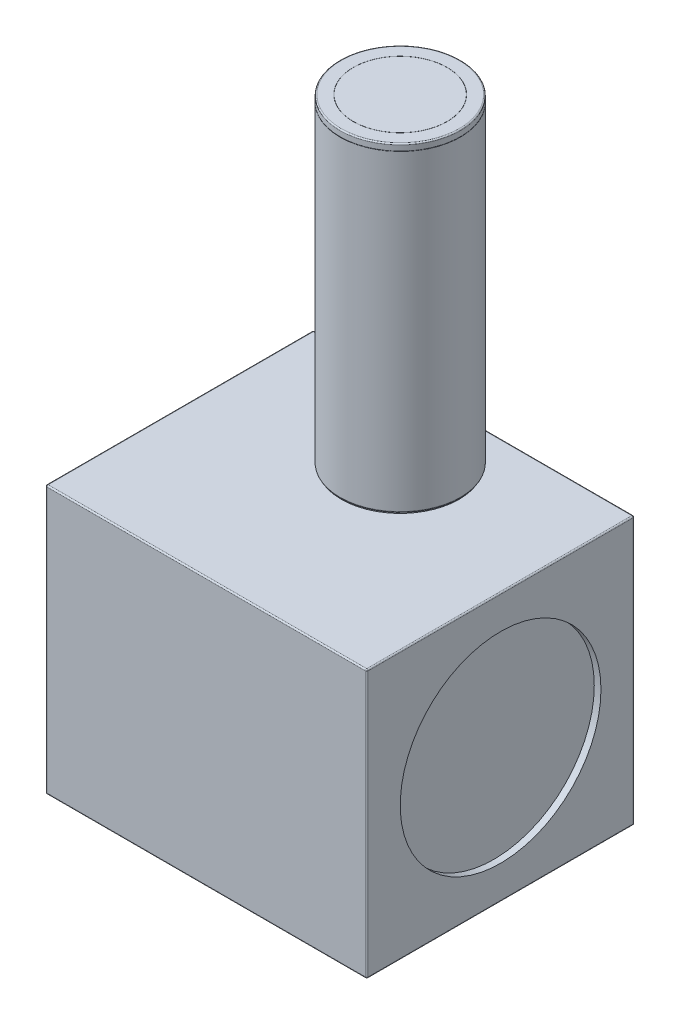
ISO-10303-21;
HEADER;
FILE_DESCRIPTION(('STEP AP214'),'2;1');
FILE_NAME('part.step','',(''),(''),'','','');
FILE_SCHEMA(('AUTOMOTIVE_DESIGN { 1 0 10303 214 1 1 1 1 }'));
ENDSEC;
DATA;
#1=APPLICATION_CONTEXT('core data for automotive mechanical design processes');
#2=APPLICATION_PROTOCOL_DEFINITION('international standard','automotive_design',2000,#1);
#3=PRODUCT_CONTEXT('',#1,'mechanical');
#4=PRODUCT('Part','Part','',(#3));
#5=PRODUCT_RELATED_PRODUCT_CATEGORY('part','',(#4));
#6=PRODUCT_DEFINITION_FORMATION('','',#4);
#7=PRODUCT_DEFINITION_CONTEXT('part definition',#1,'design');
#8=PRODUCT_DEFINITION('design','',#6,#7);
#9=PRODUCT_DEFINITION_SHAPE('','',#8);
#10=(LENGTH_UNIT() NAMED_UNIT(*) SI_UNIT(.MILLI.,.METRE.));
#11=(NAMED_UNIT(*) PLANE_ANGLE_UNIT() SI_UNIT($,.RADIAN.));
#12=(NAMED_UNIT(*) SI_UNIT($,.STERADIAN.) SOLID_ANGLE_UNIT());
#13=UNCERTAINTY_MEASURE_WITH_UNIT(LENGTH_MEASURE(1.E-05),#10,'distance_accuracy_value','');
#14=(GEOMETRIC_REPRESENTATION_CONTEXT(3) GLOBAL_UNCERTAINTY_ASSIGNED_CONTEXT((#13)) GLOBAL_UNIT_ASSIGNED_CONTEXT((#10,
#11,#12)) REPRESENTATION_CONTEXT('',''));
#15=CARTESIAN_POINT('',(0.,0.,0.));
#16=DIRECTION('',(0.,0.,1.));
#17=DIRECTION('',(1.,0.,0.));
#18=AXIS2_PLACEMENT_3D('',#15,#16,#17);
#19=CARTESIAN_POINT('',(-12.,10.,20.));
#20=DIRECTION('',(1.,0.,0.));
#21=DIRECTION('',(0.,1.,0.));
#22=AXIS2_PLACEMENT_3D('',#19,#20,#21);
#23=PLANE('',#22);
#24=DIRECTION('',(0.,-1.,0.));
#25=VECTOR('',#24,1.);
#26=CARTESIAN_POINT('',(-12.,10.,0.0999999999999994));
#27=LINE('',#26,#25);
#28=CARTESIAN_POINT('',(-12.,9.9,0.0999999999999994));
#29=VERTEX_POINT('',#28);
#30=CARTESIAN_POINT('',(-12.,-9.9,0.0999999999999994));
#31=VERTEX_POINT('',#30);
#32=EDGE_CURVE('E334',#29,#31,#27,.T.);
#33=ORIENTED_EDGE('',*,*,#32,.T.);
#34=DIRECTION('',(0.,0.,-1.));
#35=VECTOR('',#34,1.);
#36=CARTESIAN_POINT('',(-12.,-9.9,20.));
#37=LINE('',#36,#35);
#38=CARTESIAN_POINT('',(-12.,-9.9,19.9));
#39=VERTEX_POINT('',#38);
#40=EDGE_CURVE('E337',#31,#39,#37,.F.);
#41=ORIENTED_EDGE('',*,*,#40,.T.);
#42=DIRECTION('',(0.,-1.,0.));
#43=VECTOR('',#42,1.);
#44=CARTESIAN_POINT('',(-12.,10.,19.9));
#45=LINE('',#44,#43);
#46=CARTESIAN_POINT('',(-12.,9.9,19.9));
#47=VERTEX_POINT('',#46);
#48=EDGE_CURVE('E332',#39,#47,#45,.F.);
#49=ORIENTED_EDGE('',*,*,#48,.T.);
#50=DIRECTION('',(0.,0.,-1.));
#51=VECTOR('',#50,1.);
#52=CARTESIAN_POINT('',(-12.,9.9,20.));
#53=LINE('',#52,#51);
#54=EDGE_CURVE('E330',#47,#29,#53,.T.);
#55=ORIENTED_EDGE('',*,*,#54,.T.);
#56=EDGE_LOOP('',(#33,#41,#49,#55));
#57=FACE_BOUND('',#56,.T.);
#58=CARTESIAN_POINT('',(-12.,0.,10.));
#59=DIRECTION('',(-1.,0.,0.));
#60=DIRECTION('',(0.,-1.,0.));
#61=AXIS2_PLACEMENT_3D('',#58,#59,#60);
#62=CIRCLE('',#61,7.5);
#63=CARTESIAN_POINT('',(-12.,-7.5,10.));
#64=VERTEX_POINT('',#63);
#65=EDGE_CURVE('E280',#64,#64,#62,.T.);
#66=ORIENTED_EDGE('',*,*,#65,.F.);
#67=EDGE_LOOP('',(#66));
#68=FACE_BOUND('',#67,.T.);
#69=ADVANCED_FACE('F34',(#57,#68),#23,.F.);
#70=CARTESIAN_POINT('',(-12.,-10.,20.));
#71=DIRECTION('',(0.,1.,0.));
#72=DIRECTION('',(-1.,0.,0.));
#73=AXIS2_PLACEMENT_3D('',#70,#71,#72);
#74=PLANE('',#73);
#75=DIRECTION('',(1.,0.,0.));
#76=VECTOR('',#75,1.);
#77=CARTESIAN_POINT('',(-12.,-10.,19.9));
#78=LINE('',#77,#76);
#79=CARTESIAN_POINT('',(11.9,-10.,19.9));
#80=VERTEX_POINT('',#79);
#81=CARTESIAN_POINT('',(-11.9,-10.,19.9));
#82=VERTEX_POINT('',#81);
#83=EDGE_CURVE('E296',#80,#82,#78,.F.);
#84=ORIENTED_EDGE('',*,*,#83,.T.);
#85=DIRECTION('',(0.,0.,-1.));
#86=VECTOR('',#85,1.);
#87=CARTESIAN_POINT('',(-11.9,-10.,20.));
#88=LINE('',#87,#86);
#89=CARTESIAN_POINT('',(-11.9,-10.,0.0999999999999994));
#90=VERTEX_POINT('',#89);
#91=EDGE_CURVE('E301',#82,#90,#88,.T.);
#92=ORIENTED_EDGE('',*,*,#91,.T.);
#93=DIRECTION('',(1.,0.,0.));
#94=VECTOR('',#93,1.);
#95=CARTESIAN_POINT('',(-12.,-10.,0.0999999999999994));
#96=LINE('',#95,#94);
#97=CARTESIAN_POINT('',(11.9,-10.,0.0999999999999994));
#98=VERTEX_POINT('',#97);
#99=EDGE_CURVE('E298',#90,#98,#96,.T.);
#100=ORIENTED_EDGE('',*,*,#99,.T.);
#101=DIRECTION('',(0.,0.,-1.));
#102=VECTOR('',#101,1.);
#103=CARTESIAN_POINT('',(11.9,-10.,20.));
#104=LINE('',#103,#102);
#105=EDGE_CURVE('E290',#98,#80,#104,.F.);
#106=ORIENTED_EDGE('',*,*,#105,.T.);
#107=EDGE_LOOP('',(#84,#92,#100,#106));
#108=FACE_BOUND('',#107,.T.);
#109=CARTESIAN_POINT('',(0.,-10.,5.49999999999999));
#110=DIRECTION('',(0.,1.,0.));
#111=DIRECTION('',(-1.,0.,0.));
#112=AXIS2_PLACEMENT_3D('',#109,#110,#111);
#113=CIRCLE('',#112,4.4);
#114=CARTESIAN_POINT('',(-4.4,-10.,5.49999999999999));
#115=VERTEX_POINT('',#114);
#116=EDGE_CURVE('E277',#115,#115,#113,.T.);
#117=ORIENTED_EDGE('',*,*,#116,.T.);
#118=EDGE_LOOP('',(#117));
#119=FACE_BOUND('',#118,.T.);
#120=ADVANCED_FACE('F486',(#108,#119),#74,.F.);
#121=CARTESIAN_POINT('',(12.,10.,20.));
#122=DIRECTION('',(-1.,0.,0.));
#123=DIRECTION('',(0.,0.,1.));
#124=AXIS2_PLACEMENT_3D('',#121,#122,#123);
#125=PLANE('',#124);
#126=DIRECTION('',(0.,1.,0.));
#127=VECTOR('',#126,1.);
#128=CARTESIAN_POINT('',(12.,10.,0.0999999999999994));
#129=LINE('',#128,#127);
#130=CARTESIAN_POINT('',(12.,-9.9,0.0999999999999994));
#131=VERTEX_POINT('',#130);
#132=CARTESIAN_POINT('',(12.,9.9,0.0999999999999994));
#133=VERTEX_POINT('',#132);
#134=EDGE_CURVE('E316',#131,#133,#129,.T.);
#135=ORIENTED_EDGE('',*,*,#134,.T.);
#136=DIRECTION('',(0.,0.,-1.));
#137=VECTOR('',#136,1.);
#138=CARTESIAN_POINT('',(12.,9.9,20.));
#139=LINE('',#138,#137);
#140=CARTESIAN_POINT('',(12.,9.9,19.9));
#141=VERTEX_POINT('',#140);
#142=EDGE_CURVE('E319',#133,#141,#139,.F.);
#143=ORIENTED_EDGE('',*,*,#142,.T.);
#144=DIRECTION('',(0.,1.,0.));
#145=VECTOR('',#144,1.);
#146=CARTESIAN_POINT('',(12.,-10.,19.9));
#147=LINE('',#146,#145);
#148=CARTESIAN_POINT('',(12.,-9.9,19.9));
#149=VERTEX_POINT('',#148);
#150=EDGE_CURVE('E314',#141,#149,#147,.F.);
#151=ORIENTED_EDGE('',*,*,#150,.T.);
#152=DIRECTION('',(0.,0.,-1.));
#153=VECTOR('',#152,1.);
#154=CARTESIAN_POINT('',(12.,-9.9,20.));
#155=LINE('',#154,#153);
#156=EDGE_CURVE('E312',#149,#131,#155,.T.);
#157=ORIENTED_EDGE('',*,*,#156,.T.);
#158=EDGE_LOOP('',(#135,#143,#151,#157));
#159=FACE_BOUND('',#158,.T.);
#160=CARTESIAN_POINT('',(12.,0.,10.));
#161=DIRECTION('',(1.,0.,0.));
#162=DIRECTION('',(0.,0.,-1.));
#163=AXIS2_PLACEMENT_3D('',#160,#161,#162);
#164=CIRCLE('',#163,7.5);
#165=CARTESIAN_POINT('',(12.,0.,2.5));
#166=VERTEX_POINT('',#165);
#167=EDGE_CURVE('E284',#166,#166,#164,.T.);
#168=ORIENTED_EDGE('',*,*,#167,.F.);
#169=EDGE_LOOP('',(#168));
#170=FACE_BOUND('',#169,.T.);
#171=ADVANCED_FACE('F491',(#159,#170),#125,.F.);
#172=CARTESIAN_POINT('',(-12.,10.,20.));
#173=DIRECTION('',(0.,-1.,0.));
#174=DIRECTION('',(0.,0.,-1.));
#175=AXIS2_PLACEMENT_3D('',#172,#173,#174);
#176=PLANE('',#175);
#177=DIRECTION('',(-1.,0.,0.));
#178=VECTOR('',#177,1.);
#179=CARTESIAN_POINT('',(-12.,10.,0.0999999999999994));
#180=LINE('',#179,#178);
#181=CARTESIAN_POINT('',(11.9,10.,0.0999999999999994));
#182=VERTEX_POINT('',#181);
#183=CARTESIAN_POINT('',(-11.9,10.,0.0999999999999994));
#184=VERTEX_POINT('',#183);
#185=EDGE_CURVE('E325',#182,#184,#180,.T.);
#186=ORIENTED_EDGE('',*,*,#185,.T.);
#187=DIRECTION('',(0.,0.,-1.));
#188=VECTOR('',#187,1.);
#189=CARTESIAN_POINT('',(-11.9,10.,20.));
#190=LINE('',#189,#188);
#191=CARTESIAN_POINT('',(-11.9,10.,19.9));
#192=VERTEX_POINT('',#191);
#193=EDGE_CURVE('E328',#184,#192,#190,.F.);
#194=ORIENTED_EDGE('',*,*,#193,.T.);
#195=DIRECTION('',(-1.,0.,0.));
#196=VECTOR('',#195,1.);
#197=CARTESIAN_POINT('',(12.,10.,19.9));
#198=LINE('',#197,#196);
#199=CARTESIAN_POINT('',(11.9,10.,19.9));
#200=VERTEX_POINT('',#199);
#201=EDGE_CURVE('E323',#192,#200,#198,.F.);
#202=ORIENTED_EDGE('',*,*,#201,.T.);
#203=DIRECTION('',(0.,0.,-1.));
#204=VECTOR('',#203,1.);
#205=CARTESIAN_POINT('',(11.9,10.,20.));
#206=LINE('',#205,#204);
#207=EDGE_CURVE('E321',#200,#182,#206,.T.);
#208=ORIENTED_EDGE('',*,*,#207,.T.);
#209=EDGE_LOOP('',(#186,#194,#202,#208));
#210=FACE_BOUND('',#209,.T.);
#211=CARTESIAN_POINT('',(0.,10.,5.5));
#212=DIRECTION('',(0.,-1.,0.));
#213=DIRECTION('',(0.,0.,-1.));
#214=AXIS2_PLACEMENT_3D('',#211,#212,#213);
#215=CIRCLE('',#214,4.4);
#216=CARTESIAN_POINT('',(0.,10.,1.1));
#217=VERTEX_POINT('',#216);
#218=EDGE_CURVE('E276',#217,#217,#215,.T.);
#219=ORIENTED_EDGE('',*,*,#218,.T.);
#220=EDGE_LOOP('',(#219));
#221=FACE_BOUND('',#220,.T.);
#222=ADVANCED_FACE('F454',(#210,#221),#176,.F.);
#223=CARTESIAN_POINT('',(-12.,-10.,20.));
#224=DIRECTION('',(0.,0.,1.));
#225=DIRECTION('',(1.,0.,0.));
#226=AXIS2_PLACEMENT_3D('',#223,#224,#225);
#227=PLANE('',#226);
#228=DIRECTION('',(0.,1.,0.));
#229=VECTOR('',#228,1.);
#230=CARTESIAN_POINT('',(11.9,10.,20.));
#231=LINE('',#230,#229);
#232=CARTESIAN_POINT('',(11.9,-9.9,20.));
#233=VERTEX_POINT('',#232);
#234=CARTESIAN_POINT('',(11.9,9.9,20.));
#235=VERTEX_POINT('',#234);
#236=EDGE_CURVE('E43',#233,#235,#231,.T.);
#237=ORIENTED_EDGE('',*,*,#236,.T.);
#238=DIRECTION('',(-1.,0.,0.));
#239=VECTOR('',#238,1.);
#240=CARTESIAN_POINT('',(-12.,9.9,20.));
#241=LINE('',#240,#239);
#242=CARTESIAN_POINT('',(-11.9,9.9,20.));
#243=VERTEX_POINT('',#242);
#244=EDGE_CURVE('E11',#235,#243,#241,.T.);
#245=ORIENTED_EDGE('',*,*,#244,.T.);
#246=DIRECTION('',(0.,-1.,0.));
#247=VECTOR('',#246,1.);
#248=CARTESIAN_POINT('',(-11.9,-10.,20.));
#249=LINE('',#248,#247);
#250=CARTESIAN_POINT('',(-11.9,-9.9,20.));
#251=VERTEX_POINT('',#250);
#252=EDGE_CURVE('E339',#243,#251,#249,.T.);
#253=ORIENTED_EDGE('',*,*,#252,.T.);
#254=DIRECTION('',(1.,0.,0.));
#255=VECTOR('',#254,1.);
#256=CARTESIAN_POINT('',(12.,-9.9,20.));
#257=LINE('',#256,#255);
#258=EDGE_CURVE('E54',#251,#233,#257,.T.);
#259=ORIENTED_EDGE('',*,*,#258,.T.);
#260=EDGE_LOOP('',(#237,#245,#253,#259));
#261=FACE_BOUND('',#260,.T.);
#262=ADVANCED_FACE('F431',(#261),#227,.T.);
#263=CARTESIAN_POINT('',(-12.,-10.,0.));
#264=DIRECTION('',(0.,0.,1.));
#265=DIRECTION('',(1.,0.,0.));
#266=AXIS2_PLACEMENT_3D('',#263,#264,#265);
#267=PLANE('',#266);
#268=DIRECTION('',(0.,1.,0.));
#269=VECTOR('',#268,1.);
#270=CARTESIAN_POINT('',(11.9,-10.,0.));
#271=LINE('',#270,#269);
#272=CARTESIAN_POINT('',(11.9,9.9,0.));
#273=VERTEX_POINT('',#272);
#274=CARTESIAN_POINT('',(11.9,-9.9,0.));
#275=VERTEX_POINT('',#274);
#276=EDGE_CURVE('E307',#273,#275,#271,.F.);
#277=ORIENTED_EDGE('',*,*,#276,.T.);
#278=DIRECTION('',(1.,0.,0.));
#279=VECTOR('',#278,1.);
#280=CARTESIAN_POINT('',(-12.,-9.9,0.));
#281=LINE('',#280,#279);
#282=CARTESIAN_POINT('',(-11.9,-9.9,0.));
#283=VERTEX_POINT('',#282);
#284=EDGE_CURVE('E309',#275,#283,#281,.F.);
#285=ORIENTED_EDGE('',*,*,#284,.T.);
#286=DIRECTION('',(0.,-1.,0.));
#287=VECTOR('',#286,1.);
#288=CARTESIAN_POINT('',(-11.9,-10.,0.));
#289=LINE('',#288,#287);
#290=CARTESIAN_POINT('',(-11.9,9.9,0.));
#291=VERTEX_POINT('',#290);
#292=EDGE_CURVE('E303',#283,#291,#289,.F.);
#293=ORIENTED_EDGE('',*,*,#292,.T.);
#294=DIRECTION('',(-1.,0.,0.));
#295=VECTOR('',#294,1.);
#296=CARTESIAN_POINT('',(-12.,9.9,0.));
#297=LINE('',#296,#295);
#298=EDGE_CURVE('E305',#291,#273,#297,.F.);
#299=ORIENTED_EDGE('',*,*,#298,.T.);
#300=EDGE_LOOP('',(#277,#285,#293,#299));
#301=FACE_BOUND('',#300,.T.);
#302=ADVANCED_FACE('F528',(#301),#267,.F.);
#303=CARTESIAN_POINT('',(11.5,0.,10.));
#304=DIRECTION('',(1.,0.,0.));
#305=DIRECTION('',(0.,0.,-1.));
#306=AXIS2_PLACEMENT_3D('',#303,#304,#305);
#307=CYLINDRICAL_SURFACE('',#306,7.5);
#308=CARTESIAN_POINT('',(11.5,0.,10.));
#309=DIRECTION('',(1.,0.,0.));
#310=DIRECTION('',(0.,0.,-1.));
#311=AXIS2_PLACEMENT_3D('',#308,#309,#310);
#312=CIRCLE('',#311,7.5);
#313=CARTESIAN_POINT('',(11.5,0.,2.5));
#314=VERTEX_POINT('',#313);
#315=EDGE_CURVE('E287',#314,#314,#312,.T.);
#316=ORIENTED_EDGE('',*,*,#315,.F.);
#317=EDGE_LOOP('',(#316));
#318=FACE_BOUND('',#317,.T.);
#319=ORIENTED_EDGE('',*,*,#167,.T.);
#320=EDGE_LOOP('',(#319));
#321=FACE_BOUND('',#320,.T.);
#322=ADVANCED_FACE('F581',(#318,#321),#307,.F.);
#323=CARTESIAN_POINT('',(11.5,0.,10.));
#324=DIRECTION('',(1.,0.,0.));
#325=DIRECTION('',(0.,0.,-1.));
#326=AXIS2_PLACEMENT_3D('',#323,#324,#325);
#327=PLANE('',#326);
#328=ORIENTED_EDGE('',*,*,#315,.T.);
#329=EDGE_LOOP('',(#328));
#330=FACE_BOUND('',#329,.T.);
#331=ADVANCED_FACE('F577',(#330),#327,.T.);
#332=CARTESIAN_POINT('',(-11.5,0.,10.));
#333=DIRECTION('',(-1.,0.,0.));
#334=DIRECTION('',(0.,-1.,0.));
#335=AXIS2_PLACEMENT_3D('',#332,#333,#334);
#336=CYLINDRICAL_SURFACE('',#335,7.5);
#337=CARTESIAN_POINT('',(-11.5,0.,10.));
#338=DIRECTION('',(-1.,0.,0.));
#339=DIRECTION('',(0.,-1.,0.));
#340=AXIS2_PLACEMENT_3D('',#337,#338,#339);
#341=CIRCLE('',#340,7.5);
#342=CARTESIAN_POINT('',(-11.5,-7.5,10.));
#343=VERTEX_POINT('',#342);
#344=EDGE_CURVE('E281',#343,#343,#341,.T.);
#345=ORIENTED_EDGE('',*,*,#344,.F.);
#346=EDGE_LOOP('',(#345));
#347=FACE_BOUND('',#346,.T.);
#348=ORIENTED_EDGE('',*,*,#65,.T.);
#349=EDGE_LOOP('',(#348));
#350=FACE_BOUND('',#349,.T.);
#351=ADVANCED_FACE('F573',(#347,#350),#336,.F.);
#352=CARTESIAN_POINT('',(-11.5,0.,10.));
#353=DIRECTION('',(-1.,0.,0.));
#354=DIRECTION('',(0.,-1.,0.));
#355=AXIS2_PLACEMENT_3D('',#352,#353,#354);
#356=PLANE('',#355);
#357=ORIENTED_EDGE('',*,*,#344,.T.);
#358=EDGE_LOOP('',(#357));
#359=FACE_BOUND('',#358,.T.);
#360=ADVANCED_FACE('F569',(#359),#356,.T.);
#361=CARTESIAN_POINT('',(0.,34.,9.));
#362=DIRECTION('',(0.,1.,0.));
#363=DIRECTION('',(0.,0.,1.));
#364=AXIS2_PLACEMENT_3D('',#361,#362,#363);
#365=PLANE('',#364);
#366=CARTESIAN_POINT('',(0.,34.,5.5));
#367=DIRECTION('',(0.,1.,0.));
#368=DIRECTION('',(0.,0.,1.));
#369=AXIS2_PLACEMENT_3D('',#366,#367,#368);
#370=CIRCLE('',#369,3.5);
#371=CARTESIAN_POINT('',(0.,34.,9.));
#372=VERTEX_POINT('',#371);
#373=EDGE_CURVE('E209',#372,#372,#370,.T.);
#374=ORIENTED_EDGE('',*,*,#373,.T.);
#375=EDGE_LOOP('',(#374));
#376=FACE_BOUND('',#375,.T.);
#377=ADVANCED_FACE('F572',(#376),#365,.T.);
#378=CARTESIAN_POINT('',(0.,34.,5.5));
#379=DIRECTION('',(0.,1.,0.));
#380=DIRECTION('',(0.,0.,1.));
#381=AXIS2_PLACEMENT_3D('',#378,#379,#380);
#382=CYLINDRICAL_SURFACE('',#381,3.5);
#383=CARTESIAN_POINT('',(0.,33.9,5.5));
#384=DIRECTION('',(0.,1.,0.));
#385=DIRECTION('',(0.,0.,1.));
#386=AXIS2_PLACEMENT_3D('',#383,#384,#385);
#387=CIRCLE('',#386,3.5);
#388=CARTESIAN_POINT('',(0.,33.9,9.));
#389=VERTEX_POINT('',#388);
#390=EDGE_CURVE('E219',#389,#389,#387,.T.);
#391=ORIENTED_EDGE('',*,*,#390,.T.);
#392=EDGE_LOOP('',(#391));
#393=FACE_BOUND('',#392,.T.);
#394=ORIENTED_EDGE('',*,*,#373,.F.);
#395=EDGE_LOOP('',(#394));
#396=FACE_BOUND('',#395,.T.);
#397=ADVANCED_FACE('F635',(#393,#396),#382,.T.);
#398=CARTESIAN_POINT('',(0.,33.9,9.01));
#399=DIRECTION('',(0.,1.,0.));
#400=DIRECTION('',(0.,0.,1.));
#401=AXIS2_PLACEMENT_3D('',#398,#399,#400);
#402=PLANE('',#401);
#403=CARTESIAN_POINT('',(0.,33.9,5.5));
#404=DIRECTION('',(0.,1.,0.));
#405=DIRECTION('',(0.,0.,1.));
#406=AXIS2_PLACEMENT_3D('',#403,#404,#405);
#407=CIRCLE('',#406,3.51);
#408=CARTESIAN_POINT('',(0.,33.9,9.01));
#409=VERTEX_POINT('',#408);
#410=EDGE_CURVE('E222',#409,#409,#407,.T.);
#411=ORIENTED_EDGE('',*,*,#410,.T.);
#412=EDGE_LOOP('',(#411));
#413=FACE_BOUND('',#412,.T.);
#414=ORIENTED_EDGE('',*,*,#390,.F.);
#415=EDGE_LOOP('',(#414));
#416=FACE_BOUND('',#415,.T.);
#417=ADVANCED_FACE('F643',(#413,#416),#402,.T.);
#418=CARTESIAN_POINT('',(0.,34.,5.5));
#419=DIRECTION('',(0.,1.,0.));
#420=DIRECTION('',(0.,0.,1.));
#421=AXIS2_PLACEMENT_3D('',#418,#419,#420);
#422=CYLINDRICAL_SURFACE('',#421,3.51);
#423=CARTESIAN_POINT('',(0.,34.,5.5));
#424=DIRECTION('',(0.,1.,0.));
#425=DIRECTION('',(0.,0.,1.));
#426=AXIS2_PLACEMENT_3D('',#423,#424,#425);
#427=CIRCLE('',#426,3.51);
#428=CARTESIAN_POINT('',(0.,34.,9.01));
#429=VERTEX_POINT('',#428);
#430=EDGE_CURVE('E225',#429,#429,#427,.T.);
#431=ORIENTED_EDGE('',*,*,#430,.T.);
#432=EDGE_LOOP('',(#431));
#433=FACE_BOUND('',#432,.T.);
#434=ORIENTED_EDGE('',*,*,#410,.F.);
#435=EDGE_LOOP('',(#434));
#436=FACE_BOUND('',#435,.T.);
#437=ADVANCED_FACE('F651',(#433,#436),#422,.F.);
#438=CARTESIAN_POINT('',(0.,34.,9.91));
#439=DIRECTION('',(0.,1.,0.));
#440=DIRECTION('',(0.,0.,1.));
#441=AXIS2_PLACEMENT_3D('',#438,#439,#440);
#442=PLANE('',#441);
#443=CARTESIAN_POINT('',(0.,34.,5.5));
#444=DIRECTION('',(0.,1.,0.));
#445=DIRECTION('',(0.,0.,1.));
#446=AXIS2_PLACEMENT_3D('',#443,#444,#445);
#447=CIRCLE('',#446,4.41);
#448=CARTESIAN_POINT('',(0.,34.,9.91));
#449=VERTEX_POINT('',#448);
#450=EDGE_CURVE('E228',#449,#449,#447,.T.);
#451=ORIENTED_EDGE('',*,*,#450,.T.);
#452=EDGE_LOOP('',(#451));
#453=FACE_BOUND('',#452,.T.);
#454=ORIENTED_EDGE('',*,*,#430,.F.);
#455=EDGE_LOOP('',(#454));
#456=FACE_BOUND('',#455,.T.);
#457=ADVANCED_FACE('F659',(#453,#456),#442,.T.);
#458=CARTESIAN_POINT('',(0.,33.91,5.5));
#459=DIRECTION('',(0.,1.,0.));
#460=DIRECTION('',(0.,0.,1.));
#461=AXIS2_PLACEMENT_3D('',#458,#459,#460);
#462=TOROIDAL_SURFACE('',#461,4.41,0.0899999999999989);
#463=CARTESIAN_POINT('',(0.,33.91,5.5));
#464=DIRECTION('',(0.,1.,0.));
#465=DIRECTION('',(0.,0.,1.));
#466=AXIS2_PLACEMENT_3D('',#463,#464,#465);
#467=CIRCLE('',#466,4.5);
#468=CARTESIAN_POINT('',(0.,33.91,9.99999999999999));
#469=VERTEX_POINT('',#468);
#470=EDGE_CURVE('E231',#469,#469,#467,.T.);
#471=ORIENTED_EDGE('',*,*,#470,.T.);
#472=EDGE_LOOP('',(#471));
#473=FACE_BOUND('',#472,.T.);
#474=ORIENTED_EDGE('',*,*,#450,.F.);
#475=EDGE_LOOP('',(#474));
#476=FACE_BOUND('',#475,.T.);
#477=ADVANCED_FACE('F668',(#473,#476),#462,.T.);
#478=CARTESIAN_POINT('',(0.,34.,5.5));
#479=DIRECTION('',(0.,1.,0.));
#480=DIRECTION('',(0.,0.,1.));
#481=AXIS2_PLACEMENT_3D('',#478,#479,#480);
#482=CYLINDRICAL_SURFACE('',#481,4.5);
#483=CARTESIAN_POINT('',(0.,33.519,5.5));
#484=DIRECTION('',(0.,1.,0.));
#485=DIRECTION('',(0.,0.,1.));
#486=AXIS2_PLACEMENT_3D('',#483,#484,#485);
#487=CIRCLE('',#486,4.5);
#488=CARTESIAN_POINT('',(0.,33.519,9.99999999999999));
#489=VERTEX_POINT('',#488);
#490=EDGE_CURVE('E234',#489,#489,#487,.T.);
#491=ORIENTED_EDGE('',*,*,#490,.T.);
#492=EDGE_LOOP('',(#491));
#493=FACE_BOUND('',#492,.T.);
#494=ORIENTED_EDGE('',*,*,#470,.F.);
#495=EDGE_LOOP('',(#494));
#496=FACE_BOUND('',#495,.T.);
#497=ADVANCED_FACE('F675',(#493,#496),#482,.T.);
#498=CARTESIAN_POINT('',(0.,33.519,5.5));
#499=DIRECTION('',(0.,1.,0.));
#500=DIRECTION('',(0.,0.,1.));
#501=AXIS2_PLACEMENT_3D('',#498,#499,#500);
#502=TOROIDAL_SURFACE('',#501,4.491,0.00899999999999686);
#503=CARTESIAN_POINT('',(0.,33.51,5.5));
#504=DIRECTION('',(0.,1.,0.));
#505=DIRECTION('',(0.,0.,1.));
#506=AXIS2_PLACEMENT_3D('',#503,#504,#505);
#507=CIRCLE('',#506,4.491);
#508=CARTESIAN_POINT('',(0.,33.51,9.991));
#509=VERTEX_POINT('',#508);
#510=EDGE_CURVE('E237',#509,#509,#507,.T.);
#511=ORIENTED_EDGE('',*,*,#510,.T.);
#512=EDGE_LOOP('',(#511));
#513=FACE_BOUND('',#512,.T.);
#514=ORIENTED_EDGE('',*,*,#490,.F.);
#515=EDGE_LOOP('',(#514));
#516=FACE_BOUND('',#515,.T.);
#517=ADVANCED_FACE('F683',(#513,#516),#502,.T.);
#518=CARTESIAN_POINT('',(0.,33.51,9.991));
#519=DIRECTION('',(0.,-1.,0.));
#520=DIRECTION('',(0.,0.,-1.));
#521=AXIS2_PLACEMENT_3D('',#518,#519,#520);
#522=PLANE('',#521);
#523=CARTESIAN_POINT('',(0.,33.51,5.5));
#524=DIRECTION('',(0.,1.,0.));
#525=DIRECTION('',(0.,0.,1.));
#526=AXIS2_PLACEMENT_3D('',#523,#524,#525);
#527=CIRCLE('',#526,4.49);
#528=CARTESIAN_POINT('',(0.,33.51,9.99));
#529=VERTEX_POINT('',#528);
#530=EDGE_CURVE('E240',#529,#529,#527,.T.);
#531=ORIENTED_EDGE('',*,*,#530,.T.);
#532=EDGE_LOOP('',(#531));
#533=FACE_BOUND('',#532,.T.);
#534=ORIENTED_EDGE('',*,*,#510,.F.);
#535=EDGE_LOOP('',(#534));
#536=FACE_BOUND('',#535,.T.);
#537=ADVANCED_FACE('F692',(#533,#536),#522,.T.);
#538=CARTESIAN_POINT('',(0.,34.,5.5));
#539=DIRECTION('',(0.,1.,0.));
#540=DIRECTION('',(0.,0.,1.));
#541=AXIS2_PLACEMENT_3D('',#538,#539,#540);
#542=CYLINDRICAL_SURFACE('',#541,4.49);
#543=CARTESIAN_POINT('',(0.,33.5,5.5));
#544=DIRECTION('',(0.,1.,0.));
#545=DIRECTION('',(0.,0.,1.));
#546=AXIS2_PLACEMENT_3D('',#543,#544,#545);
#547=CIRCLE('',#546,4.49);
#548=CARTESIAN_POINT('',(0.,33.5,9.98999999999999));
#549=VERTEX_POINT('',#548);
#550=EDGE_CURVE('E243',#549,#549,#547,.T.);
#551=ORIENTED_EDGE('',*,*,#550,.T.);
#552=EDGE_LOOP('',(#551));
#553=FACE_BOUND('',#552,.T.);
#554=ORIENTED_EDGE('',*,*,#530,.F.);
#555=EDGE_LOOP('',(#554));
#556=FACE_BOUND('',#555,.T.);
#557=ADVANCED_FACE('F700',(#553,#556),#542,.T.);
#558=CARTESIAN_POINT('',(0.,33.5,9.98999999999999));
#559=DIRECTION('',(0.,1.,0.));
#560=DIRECTION('',(0.,0.,1.));
#561=AXIS2_PLACEMENT_3D('',#558,#559,#560);
#562=PLANE('',#561);
#563=CARTESIAN_POINT('',(0.,33.5,5.5));
#564=DIRECTION('',(0.,1.,0.));
#565=DIRECTION('',(0.,0.,1.));
#566=AXIS2_PLACEMENT_3D('',#563,#564,#565);
#567=CIRCLE('',#566,4.491);
#568=CARTESIAN_POINT('',(0.,33.5,9.991));
#569=VERTEX_POINT('',#568);
#570=EDGE_CURVE('E246',#569,#569,#567,.T.);
#571=ORIENTED_EDGE('',*,*,#570,.T.);
#572=EDGE_LOOP('',(#571));
#573=FACE_BOUND('',#572,.T.);
#574=ORIENTED_EDGE('',*,*,#550,.F.);
#575=EDGE_LOOP('',(#574));
#576=FACE_BOUND('',#575,.T.);
#577=ADVANCED_FACE('F708',(#573,#576),#562,.T.);
#578=CARTESIAN_POINT('',(0.,33.491,5.5));
#579=DIRECTION('',(0.,1.,0.));
#580=DIRECTION('',(0.,0.,1.));
#581=AXIS2_PLACEMENT_3D('',#578,#579,#580);
#582=TOROIDAL_SURFACE('',#581,4.491,0.00899999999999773);
#583=CARTESIAN_POINT('',(0.,33.491,5.5));
#584=DIRECTION('',(0.,1.,0.));
#585=DIRECTION('',(0.,0.,1.));
#586=AXIS2_PLACEMENT_3D('',#583,#584,#585);
#587=CIRCLE('',#586,4.5);
#588=CARTESIAN_POINT('',(0.,33.491,9.99999999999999));
#589=VERTEX_POINT('',#588);
#590=EDGE_CURVE('E249',#589,#589,#587,.T.);
#591=ORIENTED_EDGE('',*,*,#590,.T.);
#592=EDGE_LOOP('',(#591));
#593=FACE_BOUND('',#592,.T.);
#594=ORIENTED_EDGE('',*,*,#570,.F.);
#595=EDGE_LOOP('',(#594));
#596=FACE_BOUND('',#595,.T.);
#597=ADVANCED_FACE('F716',(#593,#596),#582,.T.);
#598=CARTESIAN_POINT('',(0.,34.,5.5));
#599=DIRECTION('',(0.,1.,0.));
#600=DIRECTION('',(0.,0.,1.));
#601=AXIS2_PLACEMENT_3D('',#598,#599,#600);
#602=CYLINDRICAL_SURFACE('',#601,4.5);
#603=CARTESIAN_POINT('',(0.,10.19,5.5));
#604=DIRECTION('',(0.,1.,0.));
#605=DIRECTION('',(0.,0.,1.));
#606=AXIS2_PLACEMENT_3D('',#603,#604,#605);
#607=CIRCLE('',#606,4.5);
#608=CARTESIAN_POINT('',(0.,10.19,10.));
#609=VERTEX_POINT('',#608);
#610=EDGE_CURVE('E252',#609,#609,#607,.T.);
#611=ORIENTED_EDGE('',*,*,#610,.T.);
#612=EDGE_LOOP('',(#611));
#613=FACE_BOUND('',#612,.T.);
#614=ORIENTED_EDGE('',*,*,#590,.F.);
#615=EDGE_LOOP('',(#614));
#616=FACE_BOUND('',#615,.T.);
#617=ADVANCED_FACE('F724',(#613,#616),#602,.T.);
#618=CARTESIAN_POINT('',(0.,10.19,5.5));
#619=DIRECTION('',(0.,1.,0.));
#620=DIRECTION('',(0.,0.,1.));
#621=AXIS2_PLACEMENT_3D('',#618,#619,#620);
#622=TOROIDAL_SURFACE('',#621,4.41,0.0899999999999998);
#623=CARTESIAN_POINT('',(0.,10.1,5.5));
#624=DIRECTION('',(0.,1.,0.));
#625=DIRECTION('',(0.,0.,1.));
#626=AXIS2_PLACEMENT_3D('',#623,#624,#625);
#627=CIRCLE('',#626,4.41);
#628=CARTESIAN_POINT('',(0.,10.1,9.91));
#629=VERTEX_POINT('',#628);
#630=EDGE_CURVE('E255',#629,#629,#627,.T.);
#631=ORIENTED_EDGE('',*,*,#630,.T.);
#632=EDGE_LOOP('',(#631));
#633=FACE_BOUND('',#632,.T.);
#634=ORIENTED_EDGE('',*,*,#610,.F.);
#635=EDGE_LOOP('',(#634));
#636=FACE_BOUND('',#635,.T.);
#637=ADVANCED_FACE('F732',(#633,#636),#622,.T.);
#638=CARTESIAN_POINT('',(0.,10.1,9.9));
#639=DIRECTION('',(0.,-1.,0.));
#640=DIRECTION('',(0.,0.,-1.));
#641=AXIS2_PLACEMENT_3D('',#638,#639,#640);
#642=PLANE('',#641);
#643=CARTESIAN_POINT('',(0.,10.1,5.5));
#644=DIRECTION('',(0.,1.,0.));
#645=DIRECTION('',(0.,0.,1.));
#646=AXIS2_PLACEMENT_3D('',#643,#644,#645);
#647=CIRCLE('',#646,4.4);
#648=CARTESIAN_POINT('',(0.,10.1,9.9));
#649=VERTEX_POINT('',#648);
#650=EDGE_CURVE('E258',#649,#649,#647,.T.);
#651=ORIENTED_EDGE('',*,*,#650,.T.);
#652=EDGE_LOOP('',(#651));
#653=FACE_BOUND('',#652,.T.);
#654=ORIENTED_EDGE('',*,*,#630,.F.);
#655=EDGE_LOOP('',(#654));
#656=FACE_BOUND('',#655,.T.);
#657=ADVANCED_FACE('F549',(#653,#656),#642,.T.);
#658=CARTESIAN_POINT('',(0.,34.,5.5));
#659=DIRECTION('',(0.,1.,0.));
#660=DIRECTION('',(0.,0.,1.));
#661=AXIS2_PLACEMENT_3D('',#658,#659,#660);
#662=CYLINDRICAL_SURFACE('',#661,4.4);
#663=ORIENTED_EDGE('',*,*,#650,.F.);
#664=EDGE_LOOP('',(#663));
#665=FACE_BOUND('',#664,.T.);
#666=ORIENTED_EDGE('',*,*,#218,.F.);
#667=EDGE_LOOP('',(#666));
#668=FACE_BOUND('',#667,.T.);
#669=ADVANCED_FACE('F539',(#665,#668),#662,.T.);
#670=CARTESIAN_POINT('',(0.,-10.1,5.49999999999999));
#671=DIRECTION('',(0.,1.,0.));
#672=DIRECTION('',(0.,0.,1.));
#673=AXIS2_PLACEMENT_3D('',#670,#671,#672);
#674=CIRCLE('',#673,4.4);
#675=CARTESIAN_POINT('',(0.,-10.1,9.9));
#676=VERTEX_POINT('',#675);
#677=EDGE_CURVE('E261',#676,#676,#674,.T.);
#678=ORIENTED_EDGE('',*,*,#677,.T.);
#679=EDGE_LOOP('',(#678));
#680=FACE_BOUND('',#679,.T.);
#681=ORIENTED_EDGE('',*,*,#116,.F.);
#682=EDGE_LOOP('',(#681));
#683=FACE_BOUND('',#682,.T.);
#684=ADVANCED_FACE('F536',(#680,#683),#662,.T.);
#685=CARTESIAN_POINT('',(0.,-16.,5.49999999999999));
#686=DIRECTION('',(0.,-1.,0.));
#687=DIRECTION('',(0.,0.,-1.));
#688=AXIS2_PLACEMENT_3D('',#685,#686,#687);
#689=PLANE('',#688);
#690=DIRECTION('',(-0.866025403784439,0.,0.5));
#691=VECTOR('',#690,1.);
#692=CARTESIAN_POINT('',(2.25,-16.,6.79903810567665));
#693=LINE('',#692,#691);
#694=CARTESIAN_POINT('',(2.25,-16.,6.79903810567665));
#695=VERTEX_POINT('',#694);
#696=CARTESIAN_POINT('',(0.,-16.,8.09807621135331));
#697=VERTEX_POINT('',#696);
#698=EDGE_CURVE('E165',#695,#697,#693,.T.);
#699=ORIENTED_EDGE('',*,*,#698,.F.);
#700=DIRECTION('',(0.,0.,1.));
#701=VECTOR('',#700,1.);
#702=CARTESIAN_POINT('',(2.25,-16.,4.20096189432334));
#703=LINE('',#702,#701);
#704=CARTESIAN_POINT('',(2.25,-16.,4.20096189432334));
#705=VERTEX_POINT('',#704);
#706=EDGE_CURVE('E183',#705,#695,#703,.T.);
#707=ORIENTED_EDGE('',*,*,#706,.F.);
#708=DIRECTION('',(0.866025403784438,0.,0.5));
#709=VECTOR('',#708,1.);
#710=CARTESIAN_POINT('',(0.,-16.,2.90192378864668));
#711=LINE('',#710,#709);
#712=CARTESIAN_POINT('',(0.,-16.,2.90192378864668));
#713=VERTEX_POINT('',#712);
#714=EDGE_CURVE('E186',#713,#705,#711,.T.);
#715=ORIENTED_EDGE('',*,*,#714,.F.);
#716=DIRECTION('',(0.866025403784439,0.,-0.5));
#717=VECTOR('',#716,1.);
#718=CARTESIAN_POINT('',(-2.25,-16.,4.20096189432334));
#719=LINE('',#718,#717);
#720=CARTESIAN_POINT('',(-2.25,-16.,4.20096189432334));
#721=VERTEX_POINT('',#720);
#722=EDGE_CURVE('E202',#721,#713,#719,.T.);
#723=ORIENTED_EDGE('',*,*,#722,.F.);
#724=DIRECTION('',(0.,0.,-1.));
#725=VECTOR('',#724,1.);
#726=CARTESIAN_POINT('',(-2.25,-16.,6.79903810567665));
#727=LINE('',#726,#725);
#728=CARTESIAN_POINT('',(-2.25,-16.,6.79903810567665));
#729=VERTEX_POINT('',#728);
#730=EDGE_CURVE('E199',#729,#721,#727,.T.);
#731=ORIENTED_EDGE('',*,*,#730,.F.);
#732=DIRECTION('',(-0.866025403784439,0.,-0.5));
#733=VECTOR('',#732,1.);
#734=CARTESIAN_POINT('',(0.,-16.,8.09807621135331));
#735=LINE('',#734,#733);
#736=EDGE_CURVE('E197',#697,#729,#735,.T.);
#737=ORIENTED_EDGE('',*,*,#736,.F.);
#738=EDGE_LOOP('',(#699,#707,#715,#723,#731,#737));
#739=FACE_BOUND('',#738,.T.);
#740=CARTESIAN_POINT('',(0.,-16.,5.49999999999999));
#741=DIRECTION('',(0.,1.,0.));
#742=DIRECTION('',(0.,0.,1.));
#743=AXIS2_PLACEMENT_3D('',#740,#741,#742);
#744=CIRCLE('',#743,4.41);
#745=CARTESIAN_POINT('',(0.,-16.,9.90999999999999));
#746=VERTEX_POINT('',#745);
#747=EDGE_CURVE('E273',#746,#746,#744,.T.);
#748=ORIENTED_EDGE('',*,*,#747,.F.);
#749=EDGE_LOOP('',(#748));
#750=FACE_BOUND('',#749,.T.);
#751=ADVANCED_FACE('F538',(#739,#750),#689,.T.);
#752=CARTESIAN_POINT('',(0.,-15.91,5.49999999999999));
#753=DIRECTION('',(0.,1.,0.));
#754=DIRECTION('',(0.,0.,1.));
#755=AXIS2_PLACEMENT_3D('',#752,#753,#754);
#756=TOROIDAL_SURFACE('',#755,4.41,0.0900000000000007);
#757=ORIENTED_EDGE('',*,*,#747,.T.);
#758=EDGE_LOOP('',(#757));
#759=FACE_BOUND('',#758,.T.);
#760=CARTESIAN_POINT('',(0.,-15.91,5.49999999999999));
#761=DIRECTION('',(0.,1.,0.));
#762=DIRECTION('',(0.,0.,1.));
#763=AXIS2_PLACEMENT_3D('',#760,#761,#762);
#764=CIRCLE('',#763,4.5);
#765=CARTESIAN_POINT('',(0.,-15.91,9.99999999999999));
#766=VERTEX_POINT('',#765);
#767=EDGE_CURVE('E270',#766,#766,#764,.T.);
#768=ORIENTED_EDGE('',*,*,#767,.F.);
#769=EDGE_LOOP('',(#768));
#770=FACE_BOUND('',#769,.T.);
#771=ADVANCED_FACE('F546',(#759,#770),#756,.T.);
#772=CARTESIAN_POINT('',(0.,34.,5.5));
#773=DIRECTION('',(0.,1.,0.));
#774=DIRECTION('',(0.,0.,1.));
#775=AXIS2_PLACEMENT_3D('',#772,#773,#774);
#776=CYLINDRICAL_SURFACE('',#775,4.5);
#777=ORIENTED_EDGE('',*,*,#767,.T.);
#778=EDGE_LOOP('',(#777));
#779=FACE_BOUND('',#778,.T.);
#780=CARTESIAN_POINT('',(0.,-10.19,5.49999999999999));
#781=DIRECTION('',(0.,1.,0.));
#782=DIRECTION('',(0.,0.,1.));
#783=AXIS2_PLACEMENT_3D('',#780,#781,#782);
#784=CIRCLE('',#783,4.5);
#785=CARTESIAN_POINT('',(0.,-10.19,9.99999999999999));
#786=VERTEX_POINT('',#785);
#787=EDGE_CURVE('E267',#786,#786,#784,.T.);
#788=ORIENTED_EDGE('',*,*,#787,.F.);
#789=EDGE_LOOP('',(#788));
#790=FACE_BOUND('',#789,.T.);
#791=ADVANCED_FACE('F561',(#779,#790),#776,.T.);
#792=CARTESIAN_POINT('',(0.,-10.19,5.49999999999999));
#793=DIRECTION('',(0.,1.,0.));
#794=DIRECTION('',(0.,0.,1.));
#795=AXIS2_PLACEMENT_3D('',#792,#793,#794);
#796=TOROIDAL_SURFACE('',#795,4.41,0.0899999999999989);
#797=ORIENTED_EDGE('',*,*,#787,.T.);
#798=EDGE_LOOP('',(#797));
#799=FACE_BOUND('',#798,.T.);
#800=CARTESIAN_POINT('',(0.,-10.1,5.49999999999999));
#801=DIRECTION('',(0.,1.,0.));
#802=DIRECTION('',(0.,0.,1.));
#803=AXIS2_PLACEMENT_3D('',#800,#801,#802);
#804=CIRCLE('',#803,4.41);
#805=CARTESIAN_POINT('',(0.,-10.1,9.90999999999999));
#806=VERTEX_POINT('',#805);
#807=EDGE_CURVE('E264',#806,#806,#804,.T.);
#808=ORIENTED_EDGE('',*,*,#807,.F.);
#809=EDGE_LOOP('',(#808));
#810=FACE_BOUND('',#809,.T.);
#811=ADVANCED_FACE('F557',(#799,#810),#796,.T.);
#812=CARTESIAN_POINT('',(0.,-10.1,9.90999999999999));
#813=DIRECTION('',(0.,1.,0.));
#814=DIRECTION('',(0.,0.,1.));
#815=AXIS2_PLACEMENT_3D('',#812,#813,#814);
#816=PLANE('',#815);
#817=ORIENTED_EDGE('',*,*,#807,.T.);
#818=EDGE_LOOP('',(#817));
#819=FACE_BOUND('',#818,.T.);
#820=ORIENTED_EDGE('',*,*,#677,.F.);
#821=EDGE_LOOP('',(#820));
#822=FACE_BOUND('',#821,.T.);
#823=ADVANCED_FACE('F554',(#819,#822),#816,.T.);
#824=CARTESIAN_POINT('',(2.25,-12.,6.79903810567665));
#825=DIRECTION('',(0.5,0.,0.866025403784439));
#826=DIRECTION('',(0.866025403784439,0.,-0.5));
#827=AXIS2_PLACEMENT_3D('',#824,#825,#826);
#828=PLANE('',#827);
#829=ORIENTED_EDGE('',*,*,#698,.T.);
#830=DIRECTION('',(0.,-1.,0.));
#831=VECTOR('',#830,1.);
#832=CARTESIAN_POINT('',(0.,-12.,8.09807621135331));
#833=LINE('',#832,#831);
#834=CARTESIAN_POINT('',(0.,-12.,8.09807621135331));
#835=VERTEX_POINT('',#834);
#836=EDGE_CURVE('E158',#835,#697,#833,.T.);
#837=ORIENTED_EDGE('',*,*,#836,.F.);
#838=DIRECTION('',(-0.866025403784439,0.,0.5));
#839=VECTOR('',#838,1.);
#840=CARTESIAN_POINT('',(2.25,-12.,6.79903810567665));
#841=LINE('',#840,#839);
#842=CARTESIAN_POINT('',(2.25,-12.,6.79903810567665));
#843=VERTEX_POINT('',#842);
#844=EDGE_CURVE('E162',#843,#835,#841,.T.);
#845=ORIENTED_EDGE('',*,*,#844,.F.);
#846=DIRECTION('',(0.,-1.,0.));
#847=VECTOR('',#846,1.);
#848=CARTESIAN_POINT('',(2.25,-12.,6.79903810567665));
#849=LINE('',#848,#847);
#850=EDGE_CURVE('E207',#843,#695,#849,.T.);
#851=ORIENTED_EDGE('',*,*,#850,.T.);
#852=EDGE_LOOP('',(#829,#837,#845,#851));
#853=FACE_BOUND('',#852,.T.);
#854=ADVANCED_FACE('F160',(#853),#828,.F.);
#855=CARTESIAN_POINT('',(2.25,-12.,4.20096189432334));
#856=DIRECTION('',(1.,0.,0.));
#857=DIRECTION('',(0.,0.,-1.));
#858=AXIS2_PLACEMENT_3D('',#855,#856,#857);
#859=PLANE('',#858);
#860=ORIENTED_EDGE('',*,*,#706,.T.);
#861=ORIENTED_EDGE('',*,*,#850,.F.);
#862=DIRECTION('',(0.,0.,1.));
#863=VECTOR('',#862,1.);
#864=CARTESIAN_POINT('',(2.25,-12.,4.20096189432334));
#865=LINE('',#864,#863);
#866=CARTESIAN_POINT('',(2.25,-12.,4.20096189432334));
#867=VERTEX_POINT('',#866);
#868=EDGE_CURVE('E170',#867,#843,#865,.T.);
#869=ORIENTED_EDGE('',*,*,#868,.F.);
#870=DIRECTION('',(0.,-1.,0.));
#871=VECTOR('',#870,1.);
#872=CARTESIAN_POINT('',(2.25,-12.,4.20096189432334));
#873=LINE('',#872,#871);
#874=EDGE_CURVE('E210',#867,#705,#873,.T.);
#875=ORIENTED_EDGE('',*,*,#874,.T.);
#876=EDGE_LOOP('',(#860,#861,#869,#875));
#877=FACE_BOUND('',#876,.T.);
#878=ADVANCED_FACE('F795',(#877),#859,.F.);
#879=CARTESIAN_POINT('',(0.,-12.,2.90192378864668));
#880=DIRECTION('',(0.5,0.,-0.866025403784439));
#881=DIRECTION('',(-0.866025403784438,0.,-0.5));
#882=AXIS2_PLACEMENT_3D('',#879,#880,#881);
#883=PLANE('',#882);
#884=ORIENTED_EDGE('',*,*,#714,.T.);
#885=ORIENTED_EDGE('',*,*,#874,.F.);
#886=DIRECTION('',(0.866025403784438,0.,0.5));
#887=VECTOR('',#886,1.);
#888=CARTESIAN_POINT('',(0.,-12.,2.90192378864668));
#889=LINE('',#888,#887);
#890=CARTESIAN_POINT('',(0.,-12.,2.90192378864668));
#891=VERTEX_POINT('',#890);
#892=EDGE_CURVE('E193',#891,#867,#889,.T.);
#893=ORIENTED_EDGE('',*,*,#892,.F.);
#894=DIRECTION('',(0.,-1.,0.));
#895=VECTOR('',#894,1.);
#896=CARTESIAN_POINT('',(0.,-12.,2.90192378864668));
#897=LINE('',#896,#895);
#898=EDGE_CURVE('E212',#891,#713,#897,.T.);
#899=ORIENTED_EDGE('',*,*,#898,.T.);
#900=EDGE_LOOP('',(#884,#885,#893,#899));
#901=FACE_BOUND('',#900,.T.);
#902=ADVANCED_FACE('F804',(#901),#883,.F.);
#903=CARTESIAN_POINT('',(-2.25,-12.,4.20096189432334));
#904=DIRECTION('',(-0.5,0.,-0.866025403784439));
#905=DIRECTION('',(-0.866025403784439,0.,0.5));
#906=AXIS2_PLACEMENT_3D('',#903,#904,#905);
#907=PLANE('',#906);
#908=ORIENTED_EDGE('',*,*,#722,.T.);
#909=ORIENTED_EDGE('',*,*,#898,.F.);
#910=DIRECTION('',(0.866025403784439,0.,-0.5));
#911=VECTOR('',#910,1.);
#912=CARTESIAN_POINT('',(-2.25,-12.,4.20096189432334));
#913=LINE('',#912,#911);
#914=CARTESIAN_POINT('',(-2.25,-12.,4.20096189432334));
#915=VERTEX_POINT('',#914);
#916=EDGE_CURVE('E190',#915,#891,#913,.T.);
#917=ORIENTED_EDGE('',*,*,#916,.F.);
#918=DIRECTION('',(0.,-1.,0.));
#919=VECTOR('',#918,1.);
#920=CARTESIAN_POINT('',(-2.25,-12.,4.20096189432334));
#921=LINE('',#920,#919);
#922=EDGE_CURVE('E214',#915,#721,#921,.T.);
#923=ORIENTED_EDGE('',*,*,#922,.T.);
#924=EDGE_LOOP('',(#908,#909,#917,#923));
#925=FACE_BOUND('',#924,.T.);
#926=ADVANCED_FACE('F814',(#925),#907,.F.);
#927=CARTESIAN_POINT('',(-2.25,-12.,6.79903810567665));
#928=DIRECTION('',(-1.,0.,0.));
#929=DIRECTION('',(0.,0.,1.));
#930=AXIS2_PLACEMENT_3D('',#927,#928,#929);
#931=PLANE('',#930);
#932=ORIENTED_EDGE('',*,*,#730,.T.);
#933=ORIENTED_EDGE('',*,*,#922,.F.);
#934=DIRECTION('',(0.,0.,-1.));
#935=VECTOR('',#934,1.);
#936=CARTESIAN_POINT('',(-2.25,-12.,6.79903810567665));
#937=LINE('',#936,#935);
#938=CARTESIAN_POINT('',(-2.25,-12.,6.79903810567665));
#939=VERTEX_POINT('',#938);
#940=EDGE_CURVE('E178',#939,#915,#937,.T.);
#941=ORIENTED_EDGE('',*,*,#940,.F.);
#942=DIRECTION('',(0.,-1.,0.));
#943=VECTOR('',#942,1.);
#944=CARTESIAN_POINT('',(-2.25,-12.,6.79903810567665));
#945=LINE('',#944,#943);
#946=EDGE_CURVE('E169',#939,#729,#945,.T.);
#947=ORIENTED_EDGE('',*,*,#946,.T.);
#948=EDGE_LOOP('',(#932,#933,#941,#947));
#949=FACE_BOUND('',#948,.T.);
#950=ADVANCED_FACE('F824',(#949),#931,.F.);
#951=CARTESIAN_POINT('',(0.,-12.,8.09807621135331));
#952=DIRECTION('',(-0.5,0.,0.866025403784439));
#953=DIRECTION('',(0.866025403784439,0.,0.5));
#954=AXIS2_PLACEMENT_3D('',#951,#952,#953);
#955=PLANE('',#954);
#956=ORIENTED_EDGE('',*,*,#736,.T.);
#957=ORIENTED_EDGE('',*,*,#946,.F.);
#958=DIRECTION('',(-0.866025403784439,0.,-0.5));
#959=VECTOR('',#958,1.);
#960=CARTESIAN_POINT('',(0.,-12.,8.09807621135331));
#961=LINE('',#960,#959);
#962=EDGE_CURVE('E173',#835,#939,#961,.T.);
#963=ORIENTED_EDGE('',*,*,#962,.F.);
#964=ORIENTED_EDGE('',*,*,#836,.T.);
#965=EDGE_LOOP('',(#956,#957,#963,#964));
#966=FACE_BOUND('',#965,.T.);
#967=ADVANCED_FACE('F174',(#966),#955,.F.);
#968=CARTESIAN_POINT('',(0.,-12.,8.09807621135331));
#969=DIRECTION('',(0.,-1.,0.));
#970=DIRECTION('',(0.,0.,-1.));
#971=AXIS2_PLACEMENT_3D('',#968,#969,#970);
#972=PLANE('',#971);
#973=ORIENTED_EDGE('',*,*,#844,.T.);
#974=ORIENTED_EDGE('',*,*,#962,.T.);
#975=ORIENTED_EDGE('',*,*,#940,.T.);
#976=ORIENTED_EDGE('',*,*,#916,.T.);
#977=ORIENTED_EDGE('',*,*,#892,.T.);
#978=ORIENTED_EDGE('',*,*,#868,.T.);
#979=EDGE_LOOP('',(#973,#974,#975,#976,#977,#978));
#980=FACE_BOUND('',#979,.T.);
#981=ADVANCED_FACE('F180',(#980),#972,.T.);
#982=CARTESIAN_POINT('',(-12.,9.9,19.9));
#983=DIRECTION('',(1.,0.,0.));
#984=DIRECTION('',(0.,0.,-1.));
#985=AXIS2_PLACEMENT_3D('',#982,#983,#984);
#986=CYLINDRICAL_SURFACE('',#985,0.1);
#987=CARTESIAN_POINT('',(-11.9,9.9,19.9));
#988=DIRECTION('',(-1.,0.,0.));
#989=DIRECTION('',(0.,0.,1.));
#990=AXIS2_PLACEMENT_3D('',#987,#988,#989);
#991=CIRCLE('',#990,0.1);
#992=EDGE_CURVE('E38',#243,#192,#991,.T.);
#993=ORIENTED_EDGE('',*,*,#992,.F.);
#994=ORIENTED_EDGE('',*,*,#244,.F.);
#995=CARTESIAN_POINT('',(11.9,9.9,19.9));
#996=DIRECTION('',(1.,0.,0.));
#997=DIRECTION('',(0.,0.,-1.));
#998=AXIS2_PLACEMENT_3D('',#995,#996,#997);
#999=CIRCLE('',#998,0.1);
#1000=EDGE_CURVE('E403',#200,#235,#999,.T.);
#1001=ORIENTED_EDGE('',*,*,#1000,.F.);
#1002=ORIENTED_EDGE('',*,*,#201,.F.);
#1003=EDGE_LOOP('',(#993,#994,#1001,#1002));
#1004=FACE_BOUND('',#1003,.T.);
#1005=ADVANCED_FACE('F36',(#1004),#986,.T.);
#1006=CARTESIAN_POINT('',(-11.9,9.9,19.9));
#1007=DIRECTION('',(0.,0.,1.));
#1008=DIRECTION('',(1.,0.,0.));
#1009=AXIS2_PLACEMENT_3D('',#1006,#1007,#1008);
#1010=SPHERICAL_SURFACE('',#1009,0.1);
#1011=CARTESIAN_POINT('',(-11.9,9.9,19.9));
#1012=DIRECTION('',(0.,1.,0.));
#1013=DIRECTION('',(0.,0.,1.));
#1014=AXIS2_PLACEMENT_3D('',#1011,#1012,#1013);
#1015=CIRCLE('',#1014,0.1);
#1016=EDGE_CURVE('E398',#243,#47,#1015,.F.);
#1017=ORIENTED_EDGE('',*,*,#1016,.F.);
#1018=ORIENTED_EDGE('',*,*,#992,.T.);
#1019=CARTESIAN_POINT('',(-11.9,9.9,19.9));
#1020=DIRECTION('',(0.,0.,1.));
#1021=DIRECTION('',(1.,0.,0.));
#1022=AXIS2_PLACEMENT_3D('',#1019,#1020,#1021);
#1023=CIRCLE('',#1022,0.1);
#1024=EDGE_CURVE('E401',#47,#192,#1023,.F.);
#1025=ORIENTED_EDGE('',*,*,#1024,.F.);
#1026=EDGE_LOOP('',(#1017,#1018,#1025));
#1027=FACE_BOUND('',#1026,.T.);
#1028=ADVANCED_FACE('F414',(#1027),#1010,.T.);
#1029=CARTESIAN_POINT('',(11.9,9.9,19.9));
#1030=DIRECTION('',(0.,0.,1.));
#1031=DIRECTION('',(1.,0.,0.));
#1032=AXIS2_PLACEMENT_3D('',#1029,#1030,#1031);
#1033=SPHERICAL_SURFACE('',#1032,0.1);
#1034=CARTESIAN_POINT('',(11.9,9.9,19.9));
#1035=DIRECTION('',(0.,0.,1.));
#1036=DIRECTION('',(1.,0.,0.));
#1037=AXIS2_PLACEMENT_3D('',#1034,#1035,#1036);
#1038=CIRCLE('',#1037,0.1);
#1039=EDGE_CURVE('E392',#200,#141,#1038,.F.);
#1040=ORIENTED_EDGE('',*,*,#1039,.F.);
#1041=ORIENTED_EDGE('',*,*,#1000,.T.);
#1042=CARTESIAN_POINT('',(11.9,9.9,19.9));
#1043=DIRECTION('',(0.,1.,0.));
#1044=DIRECTION('',(-1.,0.,0.));
#1045=AXIS2_PLACEMENT_3D('',#1042,#1043,#1044);
#1046=CIRCLE('',#1045,0.1);
#1047=EDGE_CURVE('E395',#141,#235,#1046,.F.);
#1048=ORIENTED_EDGE('',*,*,#1047,.F.);
#1049=EDGE_LOOP('',(#1040,#1041,#1048));
#1050=FACE_BOUND('',#1049,.T.);
#1051=ADVANCED_FACE('F446',(#1050),#1033,.T.);
#1052=CARTESIAN_POINT('',(-11.9,9.9,20.));
#1053=DIRECTION('',(0.,0.,-1.));
#1054=DIRECTION('',(-1.,0.,0.));
#1055=AXIS2_PLACEMENT_3D('',#1052,#1053,#1054);
#1056=CYLINDRICAL_SURFACE('',#1055,0.1);
#1057=ORIENTED_EDGE('',*,*,#1024,.T.);
#1058=ORIENTED_EDGE('',*,*,#193,.F.);
#1059=CARTESIAN_POINT('',(-11.9,9.9,0.0999999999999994));
#1060=DIRECTION('',(0.,0.,-1.));
#1061=DIRECTION('',(-1.,0.,0.));
#1062=AXIS2_PLACEMENT_3D('',#1059,#1060,#1061);
#1063=CIRCLE('',#1062,0.1);
#1064=EDGE_CURVE('E387',#29,#184,#1063,.T.);
#1065=ORIENTED_EDGE('',*,*,#1064,.F.);
#1066=ORIENTED_EDGE('',*,*,#54,.F.);
#1067=EDGE_LOOP('',(#1057,#1058,#1065,#1066));
#1068=FACE_BOUND('',#1067,.T.);
#1069=ADVANCED_FACE('F420',(#1068),#1056,.T.);
#1070=CARTESIAN_POINT('',(-11.9,-10.,19.9));
#1071=DIRECTION('',(0.,1.,0.));
#1072=DIRECTION('',(-1.,0.,0.));
#1073=AXIS2_PLACEMENT_3D('',#1070,#1071,#1072);
#1074=CYLINDRICAL_SURFACE('',#1073,0.1);
#1075=ORIENTED_EDGE('',*,*,#1016,.T.);
#1076=ORIENTED_EDGE('',*,*,#48,.F.);
#1077=CARTESIAN_POINT('',(-11.9,-9.9,19.9));
#1078=DIRECTION('',(0.,-1.,0.));
#1079=DIRECTION('',(0.,0.,-1.));
#1080=AXIS2_PLACEMENT_3D('',#1077,#1078,#1079);
#1081=CIRCLE('',#1080,0.1);
#1082=EDGE_CURVE('E384',#251,#39,#1081,.T.);
#1083=ORIENTED_EDGE('',*,*,#1082,.F.);
#1084=ORIENTED_EDGE('',*,*,#252,.F.);
#1085=EDGE_LOOP('',(#1075,#1076,#1083,#1084));
#1086=FACE_BOUND('',#1085,.T.);
#1087=ADVANCED_FACE('F430',(#1086),#1074,.T.);
#1088=CARTESIAN_POINT('',(-12.,-9.9,19.9));
#1089=DIRECTION('',(-1.,0.,0.));
#1090=DIRECTION('',(0.,-1.,0.));
#1091=AXIS2_PLACEMENT_3D('',#1088,#1089,#1090);
#1092=CYLINDRICAL_SURFACE('',#1091,0.1);
#1093=CARTESIAN_POINT('',(11.9,-9.9,19.9));
#1094=DIRECTION('',(1.,0.,0.));
#1095=DIRECTION('',(0.,1.,0.));
#1096=AXIS2_PLACEMENT_3D('',#1093,#1094,#1095);
#1097=CIRCLE('',#1096,0.1);
#1098=EDGE_CURVE('E378',#233,#80,#1097,.T.);
#1099=ORIENTED_EDGE('',*,*,#1098,.F.);
#1100=ORIENTED_EDGE('',*,*,#258,.F.);
#1101=CARTESIAN_POINT('',(-11.9,-9.9,19.9));
#1102=DIRECTION('',(-1.,0.,0.));
#1103=DIRECTION('',(0.,0.,1.));
#1104=AXIS2_PLACEMENT_3D('',#1101,#1102,#1103);
#1105=CIRCLE('',#1104,0.1);
#1106=EDGE_CURVE('E381',#82,#251,#1105,.T.);
#1107=ORIENTED_EDGE('',*,*,#1106,.F.);
#1108=ORIENTED_EDGE('',*,*,#83,.F.);
#1109=EDGE_LOOP('',(#1099,#1100,#1107,#1108));
#1110=FACE_BOUND('',#1109,.T.);
#1111=ADVANCED_FACE('F435',(#1110),#1092,.T.);
#1112=CARTESIAN_POINT('',(11.9,-10.,19.9));
#1113=DIRECTION('',(0.,-1.,0.));
#1114=DIRECTION('',(0.,0.,-1.));
#1115=AXIS2_PLACEMENT_3D('',#1112,#1113,#1114);
#1116=CYLINDRICAL_SURFACE('',#1115,0.1);
#1117=ORIENTED_EDGE('',*,*,#1047,.T.);
#1118=ORIENTED_EDGE('',*,*,#236,.F.);
#1119=CARTESIAN_POINT('',(11.9,-9.9,19.9));
#1120=DIRECTION('',(0.,-1.,0.));
#1121=DIRECTION('',(0.,0.,-1.));
#1122=AXIS2_PLACEMENT_3D('',#1119,#1120,#1121);
#1123=CIRCLE('',#1122,0.1);
#1124=EDGE_CURVE('E375',#149,#233,#1123,.T.);
#1125=ORIENTED_EDGE('',*,*,#1124,.F.);
#1126=ORIENTED_EDGE('',*,*,#150,.F.);
#1127=EDGE_LOOP('',(#1117,#1118,#1125,#1126));
#1128=FACE_BOUND('',#1127,.T.);
#1129=ADVANCED_FACE('F445',(#1128),#1116,.T.);
#1130=CARTESIAN_POINT('',(11.9,9.9,20.));
#1131=DIRECTION('',(0.,0.,-1.));
#1132=DIRECTION('',(-1.,0.,0.));
#1133=AXIS2_PLACEMENT_3D('',#1130,#1131,#1132);
#1134=CYLINDRICAL_SURFACE('',#1133,0.1);
#1135=ORIENTED_EDGE('',*,*,#1039,.T.);
#1136=ORIENTED_EDGE('',*,*,#142,.F.);
#1137=CARTESIAN_POINT('',(11.9,9.9,0.0999999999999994));
#1138=DIRECTION('',(0.,0.,-1.));
#1139=DIRECTION('',(-1.,0.,0.));
#1140=AXIS2_PLACEMENT_3D('',#1137,#1138,#1139);
#1141=CIRCLE('',#1140,0.1);
#1142=EDGE_CURVE('E372',#182,#133,#1141,.T.);
#1143=ORIENTED_EDGE('',*,*,#1142,.F.);
#1144=ORIENTED_EDGE('',*,*,#207,.F.);
#1145=EDGE_LOOP('',(#1135,#1136,#1143,#1144));
#1146=FACE_BOUND('',#1145,.T.);
#1147=ADVANCED_FACE('F451',(#1146),#1134,.T.);
#1148=CARTESIAN_POINT('',(-12.,9.9,0.0999999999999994));
#1149=DIRECTION('',(-1.,0.,0.));
#1150=DIRECTION('',(0.,0.,1.));
#1151=AXIS2_PLACEMENT_3D('',#1148,#1149,#1150);
#1152=CYLINDRICAL_SURFACE('',#1151,0.1);
#1153=CARTESIAN_POINT('',(-11.9,9.9,0.0999999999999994));
#1154=DIRECTION('',(-1.,0.,0.));
#1155=DIRECTION('',(0.,0.,1.));
#1156=AXIS2_PLACEMENT_3D('',#1153,#1154,#1155);
#1157=CIRCLE('',#1156,0.1);
#1158=EDGE_CURVE('E389',#184,#291,#1157,.T.);
#1159=ORIENTED_EDGE('',*,*,#1158,.F.);
#1160=ORIENTED_EDGE('',*,*,#185,.F.);
#1161=CARTESIAN_POINT('',(11.9,9.9,0.1));
#1162=DIRECTION('',(1.,0.,0.));
#1163=DIRECTION('',(0.,0.,-1.));
#1164=AXIS2_PLACEMENT_3D('',#1161,#1162,#1163);
#1165=CIRCLE('',#1164,0.1);
#1166=EDGE_CURVE('E369',#273,#182,#1165,.T.);
#1167=ORIENTED_EDGE('',*,*,#1166,.F.);
#1168=ORIENTED_EDGE('',*,*,#298,.F.);
#1169=EDGE_LOOP('',(#1159,#1160,#1167,#1168));
#1170=FACE_BOUND('',#1169,.T.);
#1171=ADVANCED_FACE('F459',(#1170),#1152,.T.);
#1172=CARTESIAN_POINT('',(-11.9,9.9,0.1));
#1173=DIRECTION('',(0.,0.,1.));
#1174=DIRECTION('',(1.,0.,0.));
#1175=AXIS2_PLACEMENT_3D('',#1172,#1173,#1174);
#1176=SPHERICAL_SURFACE('',#1175,0.1);
#1177=ORIENTED_EDGE('',*,*,#1064,.T.);
#1178=ORIENTED_EDGE('',*,*,#1158,.T.);
#1179=CARTESIAN_POINT('',(-11.9,9.9,0.1));
#1180=DIRECTION('',(0.,1.,0.));
#1181=DIRECTION('',(0.,0.,1.));
#1182=AXIS2_PLACEMENT_3D('',#1179,#1180,#1181);
#1183=CIRCLE('',#1182,0.1);
#1184=EDGE_CURVE('E366',#29,#291,#1183,.F.);
#1185=ORIENTED_EDGE('',*,*,#1184,.F.);
#1186=EDGE_LOOP('',(#1177,#1178,#1185));
#1187=FACE_BOUND('',#1186,.T.);
#1188=ADVANCED_FACE('F463',(#1187),#1176,.T.);
#1189=CARTESIAN_POINT('',(-11.9,-9.9,19.9));
#1190=DIRECTION('',(0.,0.,1.));
#1191=DIRECTION('',(1.,0.,0.));
#1192=AXIS2_PLACEMENT_3D('',#1189,#1190,#1191);
#1193=SPHERICAL_SURFACE('',#1192,0.1);
#1194=ORIENTED_EDGE('',*,*,#1106,.T.);
#1195=ORIENTED_EDGE('',*,*,#1082,.T.);
#1196=CARTESIAN_POINT('',(-11.9,-9.9,19.9));
#1197=DIRECTION('',(0.,0.,1.));
#1198=DIRECTION('',(1.,0.,0.));
#1199=AXIS2_PLACEMENT_3D('',#1196,#1197,#1198);
#1200=CIRCLE('',#1199,0.1);
#1201=EDGE_CURVE('E363',#82,#39,#1200,.F.);
#1202=ORIENTED_EDGE('',*,*,#1201,.F.);
#1203=EDGE_LOOP('',(#1194,#1195,#1202));
#1204=FACE_BOUND('',#1203,.T.);
#1205=ADVANCED_FACE('F475',(#1204),#1193,.T.);
#1206=CARTESIAN_POINT('',(11.9,-9.9,19.9));
#1207=DIRECTION('',(0.,0.,1.));
#1208=DIRECTION('',(1.,0.,0.));
#1209=AXIS2_PLACEMENT_3D('',#1206,#1207,#1208);
#1210=SPHERICAL_SURFACE('',#1209,0.1);
#1211=ORIENTED_EDGE('',*,*,#1124,.T.);
#1212=ORIENTED_EDGE('',*,*,#1098,.T.);
#1213=CARTESIAN_POINT('',(11.9,-9.9,19.9));
#1214=DIRECTION('',(0.,0.,1.));
#1215=DIRECTION('',(1.,0.,0.));
#1216=AXIS2_PLACEMENT_3D('',#1213,#1214,#1215);
#1217=CIRCLE('',#1216,0.1);
#1218=EDGE_CURVE('E360',#149,#80,#1217,.F.);
#1219=ORIENTED_EDGE('',*,*,#1218,.F.);
#1220=EDGE_LOOP('',(#1211,#1212,#1219));
#1221=FACE_BOUND('',#1220,.T.);
#1222=ADVANCED_FACE('F441',(#1221),#1210,.T.);
#1223=CARTESIAN_POINT('',(11.9,9.9,0.1));
#1224=DIRECTION('',(0.,0.,1.));
#1225=DIRECTION('',(1.,0.,0.));
#1226=AXIS2_PLACEMENT_3D('',#1223,#1224,#1225);
#1227=SPHERICAL_SURFACE('',#1226,0.1);
#1228=ORIENTED_EDGE('',*,*,#1166,.T.);
#1229=ORIENTED_EDGE('',*,*,#1142,.T.);
#1230=CARTESIAN_POINT('',(11.9,9.9,0.0999999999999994));
#1231=DIRECTION('',(0.,1.,0.));
#1232=DIRECTION('',(0.,0.,1.));
#1233=AXIS2_PLACEMENT_3D('',#1230,#1231,#1232);
#1234=CIRCLE('',#1233,0.1);
#1235=EDGE_CURVE('E358',#273,#133,#1234,.F.);
#1236=ORIENTED_EDGE('',*,*,#1235,.F.);
#1237=EDGE_LOOP('',(#1228,#1229,#1236));
#1238=FACE_BOUND('',#1237,.T.);
#1239=ADVANCED_FACE('F482',(#1238),#1227,.T.);
#1240=CARTESIAN_POINT('',(-11.9,10.,0.0999999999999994));
#1241=DIRECTION('',(0.,-1.,0.));
#1242=DIRECTION('',(1.,0.,0.));
#1243=AXIS2_PLACEMENT_3D('',#1240,#1241,#1242);
#1244=CYLINDRICAL_SURFACE('',#1243,0.1);
#1245=ORIENTED_EDGE('',*,*,#1184,.T.);
#1246=ORIENTED_EDGE('',*,*,#292,.F.);
#1247=CARTESIAN_POINT('',(-11.9,-9.9,0.0999999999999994));
#1248=DIRECTION('',(0.,-1.,0.));
#1249=DIRECTION('',(0.,0.,-1.));
#1250=AXIS2_PLACEMENT_3D('',#1247,#1248,#1249);
#1251=CIRCLE('',#1250,0.1);
#1252=EDGE_CURVE('E355',#31,#283,#1251,.T.);
#1253=ORIENTED_EDGE('',*,*,#1252,.F.);
#1254=ORIENTED_EDGE('',*,*,#32,.F.);
#1255=EDGE_LOOP('',(#1245,#1246,#1253,#1254));
#1256=FACE_BOUND('',#1255,.T.);
#1257=ADVANCED_FACE('F466',(#1256),#1244,.T.);
#1258=CARTESIAN_POINT('',(-11.9,-9.9,20.));
#1259=DIRECTION('',(0.,0.,-1.));
#1260=DIRECTION('',(-1.,0.,0.));
#1261=AXIS2_PLACEMENT_3D('',#1258,#1259,#1260);
#1262=CYLINDRICAL_SURFACE('',#1261,0.1);
#1263=ORIENTED_EDGE('',*,*,#1201,.T.);
#1264=ORIENTED_EDGE('',*,*,#40,.F.);
#1265=CARTESIAN_POINT('',(-11.9,-9.9,0.0999999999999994));
#1266=DIRECTION('',(0.,0.,-1.));
#1267=DIRECTION('',(-1.,0.,0.));
#1268=AXIS2_PLACEMENT_3D('',#1265,#1266,#1267);
#1269=CIRCLE('',#1268,0.1);
#1270=EDGE_CURVE('E353',#90,#31,#1269,.T.);
#1271=ORIENTED_EDGE('',*,*,#1270,.F.);
#1272=ORIENTED_EDGE('',*,*,#91,.F.);
#1273=EDGE_LOOP('',(#1263,#1264,#1271,#1272));
#1274=FACE_BOUND('',#1273,.T.);
#1275=ADVANCED_FACE('F472',(#1274),#1262,.T.);
#1276=CARTESIAN_POINT('',(11.9,-9.9,20.));
#1277=DIRECTION('',(0.,0.,-1.));
#1278=DIRECTION('',(-1.,0.,0.));
#1279=AXIS2_PLACEMENT_3D('',#1276,#1277,#1278);
#1280=CYLINDRICAL_SURFACE('',#1279,0.1);
#1281=ORIENTED_EDGE('',*,*,#1218,.T.);
#1282=ORIENTED_EDGE('',*,*,#105,.F.);
#1283=CARTESIAN_POINT('',(11.9,-9.9,0.0999999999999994));
#1284=DIRECTION('',(0.,0.,-1.));
#1285=DIRECTION('',(-1.,0.,0.));
#1286=AXIS2_PLACEMENT_3D('',#1283,#1284,#1285);
#1287=CIRCLE('',#1286,0.1);
#1288=EDGE_CURVE('E350',#131,#98,#1287,.T.);
#1289=ORIENTED_EDGE('',*,*,#1288,.F.);
#1290=ORIENTED_EDGE('',*,*,#156,.F.);
#1291=EDGE_LOOP('',(#1281,#1282,#1289,#1290));
#1292=FACE_BOUND('',#1291,.T.);
#1293=ADVANCED_FACE('F510',(#1292),#1280,.T.);
#1294=CARTESIAN_POINT('',(11.9,10.,0.0999999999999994));
#1295=DIRECTION('',(0.,1.,0.));
#1296=DIRECTION('',(0.,0.,1.));
#1297=AXIS2_PLACEMENT_3D('',#1294,#1295,#1296);
#1298=CYLINDRICAL_SURFACE('',#1297,0.1);
#1299=ORIENTED_EDGE('',*,*,#1235,.T.);
#1300=ORIENTED_EDGE('',*,*,#134,.F.);
#1301=CARTESIAN_POINT('',(11.9,-9.9,0.1));
#1302=DIRECTION('',(0.,-1.,0.));
#1303=DIRECTION('',(1.,0.,0.));
#1304=AXIS2_PLACEMENT_3D('',#1301,#1302,#1303);
#1305=CIRCLE('',#1304,0.1);
#1306=EDGE_CURVE('E347',#275,#131,#1305,.T.);
#1307=ORIENTED_EDGE('',*,*,#1306,.F.);
#1308=ORIENTED_EDGE('',*,*,#276,.F.);
#1309=EDGE_LOOP('',(#1299,#1300,#1307,#1308));
#1310=FACE_BOUND('',#1309,.T.);
#1311=ADVANCED_FACE('F507',(#1310),#1298,.T.);
#1312=CARTESIAN_POINT('',(-11.9,-9.9,0.1));
#1313=DIRECTION('',(0.,0.,1.));
#1314=DIRECTION('',(1.,0.,0.));
#1315=AXIS2_PLACEMENT_3D('',#1312,#1313,#1314);
#1316=SPHERICAL_SURFACE('',#1315,0.1);
#1317=ORIENTED_EDGE('',*,*,#1270,.T.);
#1318=ORIENTED_EDGE('',*,*,#1252,.T.);
#1319=CARTESIAN_POINT('',(-11.9,-9.9,0.1));
#1320=DIRECTION('',(-1.,0.,0.));
#1321=DIRECTION('',(0.,0.,1.));
#1322=AXIS2_PLACEMENT_3D('',#1319,#1320,#1321);
#1323=CIRCLE('',#1322,0.1);
#1324=EDGE_CURVE('E345',#90,#283,#1323,.F.);
#1325=ORIENTED_EDGE('',*,*,#1324,.F.);
#1326=EDGE_LOOP('',(#1317,#1318,#1325));
#1327=FACE_BOUND('',#1326,.T.);
#1328=ADVANCED_FACE('F503',(#1327),#1316,.T.);
#1329=CARTESIAN_POINT('',(11.9,-9.9,0.1));
#1330=DIRECTION('',(0.,0.,1.));
#1331=DIRECTION('',(1.,0.,0.));
#1332=AXIS2_PLACEMENT_3D('',#1329,#1330,#1331);
#1333=SPHERICAL_SURFACE('',#1332,0.1);
#1334=ORIENTED_EDGE('',*,*,#1306,.T.);
#1335=ORIENTED_EDGE('',*,*,#1288,.T.);
#1336=CARTESIAN_POINT('',(11.9,-9.9,0.0999999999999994));
#1337=DIRECTION('',(1.,0.,0.));
#1338=DIRECTION('',(0.,0.,-1.));
#1339=AXIS2_PLACEMENT_3D('',#1336,#1337,#1338);
#1340=CIRCLE('',#1339,0.1);
#1341=EDGE_CURVE('E343',#275,#98,#1340,.F.);
#1342=ORIENTED_EDGE('',*,*,#1341,.F.);
#1343=EDGE_LOOP('',(#1334,#1335,#1342));
#1344=FACE_BOUND('',#1343,.T.);
#1345=ADVANCED_FACE('F499',(#1344),#1333,.T.);
#1346=CARTESIAN_POINT('',(-12.,-9.9,0.0999999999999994));
#1347=DIRECTION('',(1.,0.,0.));
#1348=DIRECTION('',(0.,1.,0.));
#1349=AXIS2_PLACEMENT_3D('',#1346,#1347,#1348);
#1350=CYLINDRICAL_SURFACE('',#1349,0.1);
#1351=ORIENTED_EDGE('',*,*,#1324,.T.);
#1352=ORIENTED_EDGE('',*,*,#284,.F.);
#1353=ORIENTED_EDGE('',*,*,#1341,.T.);
#1354=ORIENTED_EDGE('',*,*,#99,.F.);
#1355=EDGE_LOOP('',(#1351,#1352,#1353,#1354));
#1356=FACE_BOUND('',#1355,.T.);
#1357=ADVANCED_FACE('F496',(#1356),#1350,.T.);
#1358=CLOSED_SHELL('',(#69,#120,#171,#222,#262,#302,#322,#331,#351,#360,#377,#397,#417,#437,
#457,#477,#497,#517,#537,#557,#577,#597,#617,#637,#657,#669,#684,#751,#771,#791,#811,#823,#854,
#878,#902,#926,#950,#967,#981,#1005,#1028,#1051,#1069,#1087,#1111,#1129,#1147,#1171,#1188,#1205,
#1222,#1239,#1257,#1275,#1293,#1311,#1328,#1345,#1357));
#1359=MANIFOLD_SOLID_BREP('B2',#1358);
#1360=ADVANCED_BREP_SHAPE_REPRESENTATION('',(#18,#1359),#14);
#1361=SHAPE_DEFINITION_REPRESENTATION(#9,#1360);
ENDSEC;
END-ISO-10303-21;
